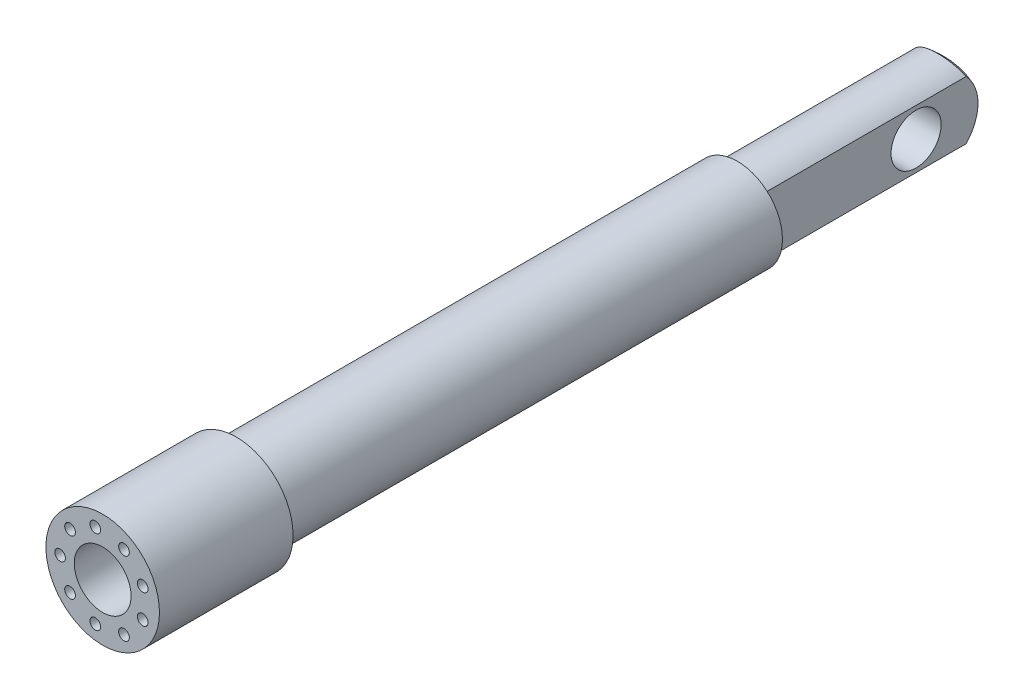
ISO-10303-21;
HEADER;
FILE_DESCRIPTION(('STEP AP214'),'2;1');
FILE_NAME('part.step','',(''),(''),'','','');
FILE_SCHEMA(('AUTOMOTIVE_DESIGN { 1 0 10303 214 1 1 1 1 }'));
ENDSEC;
DATA;
#1=APPLICATION_CONTEXT('core data for automotive mechanical design processes');
#2=APPLICATION_PROTOCOL_DEFINITION('international standard','automotive_design',2000,#1);
#3=PRODUCT_CONTEXT('',#1,'mechanical');
#4=PRODUCT('Part','Part','',(#3));
#5=PRODUCT_RELATED_PRODUCT_CATEGORY('part','',(#4));
#6=PRODUCT_DEFINITION_FORMATION('','',#4);
#7=PRODUCT_DEFINITION_CONTEXT('part definition',#1,'design');
#8=PRODUCT_DEFINITION('design','',#6,#7);
#9=PRODUCT_DEFINITION_SHAPE('','',#8);
#10=(LENGTH_UNIT() NAMED_UNIT(*) SI_UNIT(.MILLI.,.METRE.));
#11=(NAMED_UNIT(*) PLANE_ANGLE_UNIT() SI_UNIT($,.RADIAN.));
#12=(NAMED_UNIT(*) SI_UNIT($,.STERADIAN.) SOLID_ANGLE_UNIT());
#13=UNCERTAINTY_MEASURE_WITH_UNIT(LENGTH_MEASURE(1.E-05),#10,'distance_accuracy_value','');
#14=(GEOMETRIC_REPRESENTATION_CONTEXT(3) GLOBAL_UNCERTAINTY_ASSIGNED_CONTEXT((#13)) GLOBAL_UNIT_ASSIGNED_CONTEXT((#10,
#11,#12)) REPRESENTATION_CONTEXT('',''));
#15=CARTESIAN_POINT('',(0.,0.,0.));
#16=DIRECTION('',(0.,0.,1.));
#17=DIRECTION('',(1.,0.,0.));
#18=AXIS2_PLACEMENT_3D('',#15,#16,#17);
#19=CARTESIAN_POINT('',(0.,0.,-1300.));
#20=DIRECTION('',(0.,0.,1.));
#21=DIRECTION('',(1.,0.,0.));
#22=AXIS2_PLACEMENT_3D('',#19,#20,#21);
#23=CYLINDRICAL_SURFACE('',#22,57.5);
#24=CARTESIAN_POINT('',(-37.4999999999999,43.5889894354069,-1255.));
#25=CARTESIAN_POINT('',(-36.9034025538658,44.1022515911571,-1254.83220902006));
#26=CARTESIAN_POINT('',(-36.2961876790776,44.6033262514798,-1254.66486884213));
#27=CARTESIAN_POINT('',(-35.0611830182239,45.5805173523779,-1254.33216744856));
#28=CARTESIAN_POINT('',(-34.4333875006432,46.0566267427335,-1254.16680680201));
#29=CARTESIAN_POINT('',(-33.1581229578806,46.9830836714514,-1253.83921304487));
#30=CARTESIAN_POINT('',(-32.5106510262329,47.4334273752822,-1253.67698040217));
#31=CARTESIAN_POINT('',(-31.19695940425,48.3075793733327,-1253.35680326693));
#32=CARTESIAN_POINT('',(-30.5307389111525,48.7313865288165,-1253.19885895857));
#33=CARTESIAN_POINT('',(-29.1781653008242,49.5531329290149,-1252.88788306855));
#34=CARTESIAN_POINT('',(-28.4917511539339,49.9509788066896,-1252.73487012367));
#35=CARTESIAN_POINT('',(-27.1019802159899,50.7184655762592,-1252.43549675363));
#36=CARTESIAN_POINT('',(-26.3986246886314,51.0881085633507,-1252.28913583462));
#37=CARTESIAN_POINT('',(-24.9759593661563,51.7984897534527,-1252.00421358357));
#38=CARTESIAN_POINT('',(-24.2566504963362,52.1392296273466,-1251.86565180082));
#39=CARTESIAN_POINT('',(-22.8031162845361,52.7911203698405,-1251.59745208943));
#40=CARTESIAN_POINT('',(-22.0688906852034,53.1022707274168,-1251.46781431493));
#41=CARTESIAN_POINT('',(-20.3368868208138,53.7940445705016,-1251.17656833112));
#42=CARTESIAN_POINT('',(-19.3336532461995,54.162757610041,-1251.01890332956));
#43=CARTESIAN_POINT('',(-17.3054588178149,54.8444690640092,-1250.72400231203));
#44=CARTESIAN_POINT('',(-16.2804971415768,55.1574653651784,-1250.58676707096));
#45=CARTESIAN_POINT('',(-14.2120401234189,55.7262808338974,-1250.33500942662));
#46=CARTESIAN_POINT('',(-13.1685445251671,55.9820992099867,-1250.22048733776));
#47=CARTESIAN_POINT('',(-11.0686702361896,56.4347919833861,-1250.01636212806));
#48=CARTESIAN_POINT('',(-10.0123221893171,56.631785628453,-1249.92670862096));
#49=CARTESIAN_POINT('',(-7.88839565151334,56.9664727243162,-1249.77362273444));
#50=CARTESIAN_POINT('',(-6.82081723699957,57.1041665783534,-1249.7101901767));
#51=CARTESIAN_POINT('',(-4.67838378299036,57.3194689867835,-1249.61072637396));
#52=CARTESIAN_POINT('',(-3.60352936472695,57.3970826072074,-1249.57469281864));
#53=CARTESIAN_POINT('',(-1.77007023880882,57.4777466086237,-1249.53721522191));
#54=CARTESIAN_POINT('',(-1.01223942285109,57.4960861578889,-1249.52868116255));
#55=CARTESIAN_POINT('',(0.503649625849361,57.502789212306,-1249.52556364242));
#56=CARTESIAN_POINT('',(1.26170786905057,57.4911510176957,-1249.53098097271));
#57=CARTESIAN_POINT('',(2.77645316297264,57.4379282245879,-1249.55571876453));
#58=CARTESIAN_POINT('',(3.53314035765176,57.3963469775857,-1249.57503767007));
#59=CARTESIAN_POINT('',(5.04388212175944,57.2833577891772,-1249.62739761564));
#60=CARTESIAN_POINT('',(5.79793642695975,57.2119469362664,-1249.66043999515));
#61=CARTESIAN_POINT('',(7.30241576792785,57.0394459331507,-1249.73996644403));
#62=CARTESIAN_POINT('',(8.05283818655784,56.9383369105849,-1249.78645906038));
#63=CARTESIAN_POINT('',(9.54827906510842,56.7067275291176,-1249.8924571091));
#64=CARTESIAN_POINT('',(10.2932969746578,56.5762242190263,-1249.95196384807));
#65=CARTESIAN_POINT('',(11.7764686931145,56.2861939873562,-1250.08344930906));
#66=CARTESIAN_POINT('',(12.5146232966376,56.1266704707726,-1250.15542656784));
#67=CARTESIAN_POINT('',(13.9829205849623,55.7790048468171,-1250.31122394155));
#68=CARTESIAN_POINT('',(14.7130625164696,55.5908600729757,-1250.39504515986));
#69=CARTESIAN_POINT('',(16.8566202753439,54.9933644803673,-1250.65916063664));
#70=CARTESIAN_POINT('',(18.2572548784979,54.5442381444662,-1250.85519324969));
#71=CARTESIAN_POINT('',(21.0149987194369,53.5422554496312,-1251.28377684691));
#72=CARTESIAN_POINT('',(22.3721049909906,52.9893920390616,-1251.51633031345));
#73=CARTESIAN_POINT('',(25.0348045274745,51.7845786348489,-1252.01104852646));
#74=CARTESIAN_POINT('',(26.3404316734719,51.1326952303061,-1252.27319334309));
#75=CARTESIAN_POINT('',(28.894498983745,49.7340606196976,-1252.82011242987));
#76=CARTESIAN_POINT('',(30.1429562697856,48.9873380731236,-1253.10487985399));
#77=CARTESIAN_POINT('',(31.8978062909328,47.8455031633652,-1253.52662848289));
#78=CARTESIAN_POINT('',(32.4296152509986,47.486643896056,-1253.65742605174));
#79=CARTESIAN_POINT('',(33.4804530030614,46.7516864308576,-1253.92141598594));
#80=CARTESIAN_POINT('',(33.9994843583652,46.3755917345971,-1254.05460786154));
#81=CARTESIAN_POINT('',(35.0232977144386,45.6073173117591,-1254.32250880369));
#82=CARTESIAN_POINT('',(35.5281075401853,45.2151733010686,-1254.45721406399));
#83=CARTESIAN_POINT('',(36.5242775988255,44.4143631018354,-1254.72784631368));
#84=CARTESIAN_POINT('',(37.0156352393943,44.0056937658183,-1254.86377353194));
#85=CARTESIAN_POINT('',(37.5,43.5889894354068,-1255.));
#86=B_SPLINE_CURVE_WITH_KNOTS('',3,(#24,#25,#26,#27,#28,#29,#30,#31,#32,#33,#34,#35,#36,#37,#38,
#39,#40,#41,#42,#43,#44,#45,#46,#47,#48,#49,#50,#51,#52,#53,#54,#55,#56,#57,#58,#59,#60,#61,#62,
#63,#64,#65,#66,#67,#68,#69,#70,#71,#72,#73,#74,#75,#76,#77,#78,#79,#80,#81,#82,#83,#84,#85),
.UNSPECIFIED.,.F.,.F.,(4,2,2,2,2,2,2,2,2,2,2,2,2,2,2,2,2,2,2,2,2,2,2,2,2,2,2,2,2,2,4),(0.,
2.41390374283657,4.82848554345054,7.2434257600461,9.65846953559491,12.0817678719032,
14.5048860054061,16.9278639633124,19.3508837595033,22.5902167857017,25.8296726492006,
29.0691733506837,32.3020617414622,35.5349281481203,38.7675219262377,41.0411580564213,
43.3149231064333,45.5884336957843,47.8621662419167,50.1373468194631,52.4127559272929,
54.6878982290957,56.9632526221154,61.4096497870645,65.8563493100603,70.3000716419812,
74.7424543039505,76.706457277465,78.6700629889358,80.6295141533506,82.5893402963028),.UNSPECIFIED.);
#87=CARTESIAN_POINT('',(-37.4999999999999,43.5889894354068,-1255.));
#88=VERTEX_POINT('',#87);
#89=CARTESIAN_POINT('',(37.5,43.5889894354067,-1255.));
#90=VERTEX_POINT('',#89);
#91=EDGE_CURVE('E79',#88,#90,#86,.T.);
#92=ORIENTED_EDGE('',*,*,#91,.F.);
#93=DIRECTION('',(0.,0.,1.));
#94=VECTOR('',#93,1.);
#95=CARTESIAN_POINT('',(-37.4999999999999,43.5889894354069,-1300.));
#96=LINE('',#95,#94);
#97=CARTESIAN_POINT('',(-37.4999999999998,43.5889894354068,-950.));
#98=VERTEX_POINT('',#97);
#99=EDGE_CURVE('E84',#88,#98,#96,.T.);
#100=ORIENTED_EDGE('',*,*,#99,.T.);
#101=CARTESIAN_POINT('',(0.,0.,-950.));
#102=DIRECTION('',(0.,0.,1.));
#103=DIRECTION('',(1.,0.,0.));
#104=AXIS2_PLACEMENT_3D('',#101,#102,#103);
#105=CIRCLE('',#104,57.5);
#106=CARTESIAN_POINT('',(37.5,43.5889894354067,-950.));
#107=VERTEX_POINT('',#106);
#108=EDGE_CURVE('E61',#98,#107,#105,.F.);
#109=ORIENTED_EDGE('',*,*,#108,.T.);
#110=DIRECTION('',(0.,0.,1.));
#111=VECTOR('',#110,1.);
#112=CARTESIAN_POINT('',(37.5,43.5889894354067,-1300.));
#113=LINE('',#112,#111);
#114=EDGE_CURVE('E86',#107,#90,#113,.F.);
#115=ORIENTED_EDGE('',*,*,#114,.T.);
#116=EDGE_LOOP('',(#92,#100,#109,#115));
#117=FACE_BOUND('',#116,.T.);
#118=ADVANCED_FACE('F34',(#117),#23,.T.);
#119=CARTESIAN_POINT('',(37.5,-43.5889894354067,-1255.));
#120=CARTESIAN_POINT('',(36.903402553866,-44.102251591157,-1254.83220902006));
#121=CARTESIAN_POINT('',(36.2961876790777,-44.6033262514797,-1254.66486884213));
#122=CARTESIAN_POINT('',(35.061183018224,-45.5805173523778,-1254.33216744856));
#123=CARTESIAN_POINT('',(34.4333875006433,-46.0566267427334,-1254.16680680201));
#124=CARTESIAN_POINT('',(33.1581229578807,-46.9830836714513,-1253.83921304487));
#125=CARTESIAN_POINT('',(32.510651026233,-47.4334273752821,-1253.67698040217));
#126=CARTESIAN_POINT('',(31.1969594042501,-48.3075793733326,-1253.35680326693));
#127=CARTESIAN_POINT('',(30.5307389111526,-48.7313865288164,-1253.19885895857));
#128=CARTESIAN_POINT('',(29.1781653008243,-49.5531329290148,-1252.88788306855));
#129=CARTESIAN_POINT('',(28.491751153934,-49.9509788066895,-1252.73487012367));
#130=CARTESIAN_POINT('',(27.1019802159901,-50.7184655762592,-1252.43549675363));
#131=CARTESIAN_POINT('',(26.3986246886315,-51.0881085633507,-1252.28913583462));
#132=CARTESIAN_POINT('',(24.9759593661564,-51.7984897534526,-1252.00421358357));
#133=CARTESIAN_POINT('',(24.2566504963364,-52.1392296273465,-1251.86565180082));
#134=CARTESIAN_POINT('',(22.8031162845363,-52.7911203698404,-1251.59745208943));
#135=CARTESIAN_POINT('',(22.0688906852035,-53.1022707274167,-1251.46781431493));
#136=CARTESIAN_POINT('',(20.3368868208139,-53.7940445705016,-1251.17656833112));
#137=CARTESIAN_POINT('',(19.3336532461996,-54.1627576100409,-1251.01890332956));
#138=CARTESIAN_POINT('',(17.3054588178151,-54.8444690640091,-1250.72400231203));
#139=CARTESIAN_POINT('',(16.280497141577,-55.1574653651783,-1250.58676707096));
#140=CARTESIAN_POINT('',(14.2120401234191,-55.7262808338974,-1250.33500942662));
#141=CARTESIAN_POINT('',(13.1685445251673,-55.9820992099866,-1250.22048733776));
#142=CARTESIAN_POINT('',(11.0686702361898,-56.4347919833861,-1250.01636212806));
#143=CARTESIAN_POINT('',(10.0123221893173,-56.631785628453,-1249.92670862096));
#144=CARTESIAN_POINT('',(7.88839565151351,-56.9664727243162,-1249.77362273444));
#145=CARTESIAN_POINT('',(6.82081723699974,-57.1041665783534,-1249.7101901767));
#146=CARTESIAN_POINT('',(4.67838378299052,-57.3194689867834,-1249.61072637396));
#147=CARTESIAN_POINT('',(3.6035293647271,-57.3970826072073,-1249.57469281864));
#148=CARTESIAN_POINT('',(1.77007023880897,-57.4777466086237,-1249.53721522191));
#149=CARTESIAN_POINT('',(1.01223942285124,-57.4960861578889,-1249.52868116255));
#150=CARTESIAN_POINT('',(-0.503649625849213,-57.502789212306,-1249.52556364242));
#151=CARTESIAN_POINT('',(-1.26170786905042,-57.4911510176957,-1249.53098097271));
#152=CARTESIAN_POINT('',(-2.7764531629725,-57.4379282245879,-1249.55571876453));
#153=CARTESIAN_POINT('',(-3.53314035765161,-57.3963469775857,-1249.57503767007));
#154=CARTESIAN_POINT('',(-5.04388212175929,-57.2833577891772,-1249.62739761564));
#155=CARTESIAN_POINT('',(-5.79793642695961,-57.2119469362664,-1249.66043999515));
#156=CARTESIAN_POINT('',(-7.30241576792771,-57.0394459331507,-1249.73996644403));
#157=CARTESIAN_POINT('',(-8.0528381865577,-56.9383369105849,-1249.78645906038));
#158=CARTESIAN_POINT('',(-9.54827906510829,-56.7067275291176,-1249.8924571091));
#159=CARTESIAN_POINT('',(-10.2932969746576,-56.5762242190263,-1249.95196384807));
#160=CARTESIAN_POINT('',(-11.7764686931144,-56.2861939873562,-1250.08344930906));
#161=CARTESIAN_POINT('',(-12.5146232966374,-56.1266704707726,-1250.15542656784));
#162=CARTESIAN_POINT('',(-13.9829205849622,-55.7790048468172,-1250.31122394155));
#163=CARTESIAN_POINT('',(-14.7130625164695,-55.5908600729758,-1250.39504515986));
#164=CARTESIAN_POINT('',(-16.8566202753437,-54.9933644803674,-1250.65916063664));
#165=CARTESIAN_POINT('',(-18.2572548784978,-54.5442381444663,-1250.85519324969));
#166=CARTESIAN_POINT('',(-21.0149987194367,-53.5422554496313,-1251.28377684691));
#167=CARTESIAN_POINT('',(-22.3721049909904,-52.9893920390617,-1251.51633031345));
#168=CARTESIAN_POINT('',(-25.0348045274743,-51.784578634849,-1252.01104852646));
#169=CARTESIAN_POINT('',(-26.3404316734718,-51.1326952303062,-1252.27319334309));
#170=CARTESIAN_POINT('',(-28.8944989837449,-49.7340606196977,-1252.82011242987));
#171=CARTESIAN_POINT('',(-30.1429562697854,-48.9873380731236,-1253.10487985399));
#172=CARTESIAN_POINT('',(-31.8978062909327,-47.8455031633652,-1253.52662848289));
#173=CARTESIAN_POINT('',(-32.4296152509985,-47.486643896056,-1253.65742605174));
#174=CARTESIAN_POINT('',(-33.4804530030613,-46.7516864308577,-1253.92141598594));
#175=CARTESIAN_POINT('',(-33.9994843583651,-46.3755917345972,-1254.05460786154));
#176=CARTESIAN_POINT('',(-35.0232977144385,-45.6073173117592,-1254.32250880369));
#177=CARTESIAN_POINT('',(-35.5281075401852,-45.2151733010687,-1254.45721406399));
#178=CARTESIAN_POINT('',(-36.5242775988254,-44.4143631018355,-1254.72784631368));
#179=CARTESIAN_POINT('',(-37.0156352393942,-44.0056937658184,-1254.86377353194));
#180=CARTESIAN_POINT('',(-37.4999999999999,-43.5889894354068,-1255.));
#181=B_SPLINE_CURVE_WITH_KNOTS('',3,(#119,#120,#121,#122,#123,#124,#125,#126,#127,#128,#129,
#130,#131,#132,#133,#134,#135,#136,#137,#138,#139,#140,#141,#142,#143,#144,#145,#146,#147,#148,
#149,#150,#151,#152,#153,#154,#155,#156,#157,#158,#159,#160,#161,#162,#163,#164,#165,#166,#167,
#168,#169,#170,#171,#172,#173,#174,#175,#176,#177,#178,#179,#180),.UNSPECIFIED.,.F.,.F.,(4,2,2,
2,2,2,2,2,2,2,2,2,2,2,2,2,2,2,2,2,2,2,2,2,2,2,2,2,2,2,4),(0.,2.41390374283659,4.82848554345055,
7.24342576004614,9.65846953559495,12.0817678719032,14.5048860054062,16.9278639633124,
19.3508837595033,22.5902167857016,25.8296726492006,29.0691733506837,32.3020617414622,
35.5349281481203,38.7675219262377,41.0411580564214,43.3149231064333,45.5884336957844,
47.8621662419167,50.1373468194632,52.4127559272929,54.6878982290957,56.9632526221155,
61.4096497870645,65.8563493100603,70.3000716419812,74.7424543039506,76.7064572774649,
78.6700629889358,80.6295141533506,82.5893402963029),.UNSPECIFIED.);
#182=CARTESIAN_POINT('',(37.5,-43.5889894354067,-1255.));
#183=VERTEX_POINT('',#182);
#184=CARTESIAN_POINT('',(-37.4999999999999,-43.5889894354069,-1255.));
#185=VERTEX_POINT('',#184);
#186=EDGE_CURVE('E53',#183,#185,#181,.T.);
#187=ORIENTED_EDGE('',*,*,#186,.F.);
#188=DIRECTION('',(0.,0.,1.));
#189=VECTOR('',#188,1.);
#190=CARTESIAN_POINT('',(37.5,-43.5889894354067,-1300.));
#191=LINE('',#190,#189);
#192=CARTESIAN_POINT('',(37.5,-43.5889894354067,-950.));
#193=VERTEX_POINT('',#192);
#194=EDGE_CURVE('E101',#183,#193,#191,.T.);
#195=ORIENTED_EDGE('',*,*,#194,.T.);
#196=CARTESIAN_POINT('',(-37.4999999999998,-43.5889894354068,-950.));
#197=VERTEX_POINT('',#196);
#198=EDGE_CURVE('E47',#193,#197,#105,.F.);
#199=ORIENTED_EDGE('',*,*,#198,.T.);
#200=DIRECTION('',(0.,0.,1.));
#201=VECTOR('',#200,1.);
#202=CARTESIAN_POINT('',(-37.4999999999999,-43.5889894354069,-1300.));
#203=LINE('',#202,#201);
#204=EDGE_CURVE('E93',#197,#185,#203,.F.);
#205=ORIENTED_EDGE('',*,*,#204,.T.);
#206=EDGE_LOOP('',(#187,#195,#199,#205));
#207=FACE_BOUND('',#206,.T.);
#208=ADVANCED_FACE('F211',(#207),#23,.T.);
#209=CARTESIAN_POINT('',(37.5,-175.,-950.));
#210=DIRECTION('',(-1.,0.,0.));
#211=DIRECTION('',(0.,0.,1.));
#212=AXIS2_PLACEMENT_3D('',#209,#210,#211);
#213=PLANE('',#212);
#214=CARTESIAN_POINT('',(37.4999999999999,0.,-1180.));
#215=DIRECTION('',(1.,0.,0.));
#216=DIRECTION('',(0.,0.,-1.));
#217=AXIS2_PLACEMENT_3D('',#214,#215,#216);
#218=CIRCLE('',#217,37.5);
#219=CARTESIAN_POINT('',(37.4999999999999,0.,-1217.5));
#220=VERTEX_POINT('',#219);
#221=EDGE_CURVE('E178',#220,#220,#218,.T.);
#222=ORIENTED_EDGE('',*,*,#221,.F.);
#223=EDGE_LOOP('',(#222));
#224=FACE_BOUND('',#223,.T.);
#225=CARTESIAN_POINT('',(37.5,43.5889894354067,-1255.));
#226=CARTESIAN_POINT('',(37.5,42.8851714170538,-1255.63914926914));
#227=CARTESIAN_POINT('',(37.5,42.1695481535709,-1256.26534991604));
#228=CARTESIAN_POINT('',(37.5,40.7146566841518,-1257.49079116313));
#229=CARTESIAN_POINT('',(37.5,39.9753709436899,-1258.09001093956));
#230=CARTESIAN_POINT('',(37.5,38.4739110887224,-1259.25967004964));
#231=CARTESIAN_POINT('',(37.5,37.7117285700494,-1259.83009860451));
#232=CARTESIAN_POINT('',(37.5,36.1653173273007,-1260.94041957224));
#233=CARTESIAN_POINT('',(37.5,35.3810865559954,-1261.48030913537));
#234=CARTESIAN_POINT('',(37.5,33.7874318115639,-1262.53053314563));
#235=CARTESIAN_POINT('',(37.5,32.9779014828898,-1263.04070632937));
#236=CARTESIAN_POINT('',(37.5,31.3384584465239,-1264.02685974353));
#237=CARTESIAN_POINT('',(37.5,30.5085493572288,-1264.502845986));
#238=CARTESIAN_POINT('',(37.5,28.8293549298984,-1265.41907135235));
#239=CARTESIAN_POINT('',(37.5,27.9800722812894,-1265.85931539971));
#240=CARTESIAN_POINT('',(37.5,26.2632183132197,-1266.70256401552));
#241=CARTESIAN_POINT('',(37.5,25.3956467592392,-1267.10556810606));
#242=CARTESIAN_POINT('',(37.5,23.3456041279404,-1268.00328125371));
#243=CARTESIAN_POINT('',(37.5,22.1563433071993,-1268.48259278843));
#244=CARTESIAN_POINT('',(37.5,19.7508275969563,-1269.36824458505));
#245=CARTESIAN_POINT('',(37.5,18.5345700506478,-1269.77457762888));
#246=CARTESIAN_POINT('',(37.5,16.0791537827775,-1270.51117698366));
#247=CARTESIAN_POINT('',(37.5,14.8399944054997,-1270.84144111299));
#248=CARTESIAN_POINT('',(37.5,12.3466774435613,-1271.42246818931));
#249=CARTESIAN_POINT('',(37.5,11.0925694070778,-1271.67344345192));
#250=CARTESIAN_POINT('',(37.5,8.57094200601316,-1272.09503486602));
#251=CARTESIAN_POINT('',(37.5,7.30342292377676,-1272.26565270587));
#252=CARTESIAN_POINT('',(37.5,4.76012701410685,-1272.52506829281));
#253=CARTESIAN_POINT('',(37.5,3.48435128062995,-1272.61387666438));
#254=CARTESIAN_POINT('',(37.5,1.34424004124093,-1272.69353704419));
#255=CARTESIAN_POINT('',(37.5,0.480672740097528,-1272.70681863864));
#256=CARTESIAN_POINT('',(37.5,-1.2462927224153,-1272.69567353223));
#257=CARTESIAN_POINT('',(37.5,-2.10969087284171,-1272.67124489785));
#258=CARTESIAN_POINT('',(37.5,-3.83447012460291,-1272.58477284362));
#259=CARTESIAN_POINT('',(37.5,-4.69585149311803,-1272.5227347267));
#260=CARTESIAN_POINT('',(37.5,-6.41518922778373,-1272.36128624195));
#261=CARTESIAN_POINT('',(37.5,-7.27314525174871,-1272.26187223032));
#262=CARTESIAN_POINT('',(37.5,-8.98441196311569,-1272.02599630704));
#263=CARTESIAN_POINT('',(37.5,-9.83771992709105,-1271.88951465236));
#264=CARTESIAN_POINT('',(37.5,-11.5377721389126,-1271.58003467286));
#265=CARTESIAN_POINT('',(37.5,-12.3845157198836,-1271.40703268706));
#266=CARTESIAN_POINT('',(37.5,-14.0697788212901,-1271.02519060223));
#267=CARTESIAN_POINT('',(37.5,-14.9082992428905,-1270.81635447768));
#268=CARTESIAN_POINT('',(37.5,-16.5758852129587,-1270.36357218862));
#269=CARTESIAN_POINT('',(37.5,-17.4049498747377,-1270.1196227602));
#270=CARTESIAN_POINT('',(37.5,-19.0332114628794,-1269.60351841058));
#271=CARTESIAN_POINT('',(37.5,-19.8326561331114,-1269.33214428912));
#272=CARTESIAN_POINT('',(37.5,-21.4201038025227,-1268.75758817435));
#273=CARTESIAN_POINT('',(37.5,-22.2081057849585,-1268.45440337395));
#274=CARTESIAN_POINT('',(37.5,-23.7715050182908,-1267.81720607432));
#275=CARTESIAN_POINT('',(37.5,-24.5469028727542,-1267.4831950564));
#276=CARTESIAN_POINT('',(37.5,-26.0841777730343,-1266.78533728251));
#277=CARTESIAN_POINT('',(37.5,-26.846053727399,-1266.4214881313));
#278=CARTESIAN_POINT('',(37.5,-29.1095191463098,-1265.2869892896));
#279=CARTESIAN_POINT('',(37.5,-30.5896683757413,-1264.47309266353));
#280=CARTESIAN_POINT('',(37.5,-33.4857301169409,-1262.73908218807));
#281=CARTESIAN_POINT('',(37.5,-34.9016577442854,-1261.8189935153));
#282=CARTESIAN_POINT('',(37.5,-36.9230866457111,-1260.40157458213));
#283=CARTESIAN_POINT('',(37.5,-37.5556632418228,-1259.94240002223));
#284=CARTESIAN_POINT('',(37.5,-38.8056715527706,-1259.00406575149));
#285=CARTESIAN_POINT('',(37.5,-39.4231060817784,-1258.52490979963));
#286=CARTESIAN_POINT('',(37.5,-40.6409825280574,-1257.54869922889));
#287=CARTESIAN_POINT('',(37.5,-41.2414647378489,-1257.05169480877));
#288=CARTESIAN_POINT('',(37.5,-42.4269372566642,-1256.03936524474));
#289=CARTESIAN_POINT('',(37.5,-43.0119252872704,-1255.52403743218));
#290=CARTESIAN_POINT('',(37.5,-43.5889894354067,-1255.));
#291=B_SPLINE_CURVE_WITH_KNOTS('',3,(#225,#226,#227,#228,#229,#230,#231,#232,#233,#234,#235,
#236,#237,#238,#239,#240,#241,#242,#243,#244,#245,#246,#247,#248,#249,#250,#251,#252,#253,#254,
#255,#256,#257,#258,#259,#260,#261,#262,#263,#264,#265,#266,#267,#268,#269,#270,#271,#272,#273,
#274,#275,#276,#277,#278,#279,#280,#281,#282,#283,#284,#285,#286,#287,#288,#289,#290),
.UNSPECIFIED.,.F.,.F.,(4,2,2,2,2,2,2,2,2,2,2,2,2,2,2,2,2,2,2,2,2,2,2,2,2,2,2,2,2,2,2,2,4),(0.,
2.8520545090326,5.70627376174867,8.5615537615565,11.4170997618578,14.2869227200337,
17.1562397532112,20.0251608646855,22.8941187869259,26.7383640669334,30.5829893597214,
34.4277249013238,38.2620761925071,42.0963469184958,45.9301196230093,48.5203758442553,
51.1107648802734,53.7007887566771,56.2910652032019,58.8827240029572,61.4746427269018,
64.0662741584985,66.6581466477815,69.1902073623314,71.7224917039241,74.2546544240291,
76.7870206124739,81.8494182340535,86.9106180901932,89.2552797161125,91.5995022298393,
93.9375811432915,96.2760019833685),.UNSPECIFIED.);
#292=EDGE_CURVE('E87',#90,#183,#291,.T.);
#293=ORIENTED_EDGE('',*,*,#292,.F.);
#294=ORIENTED_EDGE('',*,*,#114,.F.);
#295=DIRECTION('',(0.,1.,0.));
#296=VECTOR('',#295,1.);
#297=CARTESIAN_POINT('',(37.5,-175.,-950.));
#298=LINE('',#297,#296);
#299=EDGE_CURVE('E92',#193,#107,#298,.T.);
#300=ORIENTED_EDGE('',*,*,#299,.F.);
#301=ORIENTED_EDGE('',*,*,#194,.F.);
#302=EDGE_LOOP('',(#293,#294,#300,#301));
#303=FACE_BOUND('',#302,.T.);
#304=ADVANCED_FACE('F195',(#224,#303),#213,.F.);
#305=CARTESIAN_POINT('',(-37.4999999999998,-175.,-950.));
#306=DIRECTION('',(1.,0.,0.));
#307=DIRECTION('',(0.,0.,-1.));
#308=AXIS2_PLACEMENT_3D('',#305,#306,#307);
#309=PLANE('',#308);
#310=CARTESIAN_POINT('',(-37.4999999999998,0.,-1180.));
#311=DIRECTION('',(1.,0.,0.));
#312=DIRECTION('',(0.,0.,-1.));
#313=AXIS2_PLACEMENT_3D('',#310,#311,#312);
#314=CIRCLE('',#313,37.5);
#315=CARTESIAN_POINT('',(-37.4999999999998,0.,-1217.5));
#316=VERTEX_POINT('',#315);
#317=EDGE_CURVE('E176',#316,#316,#314,.T.);
#318=ORIENTED_EDGE('',*,*,#317,.T.);
#319=EDGE_LOOP('',(#318));
#320=FACE_BOUND('',#319,.T.);
#321=CARTESIAN_POINT('',(-37.4999999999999,-43.5889894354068,-1255.));
#322=CARTESIAN_POINT('',(-37.4999999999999,-42.8843805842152,-1255.63986747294));
#323=CARTESIAN_POINT('',(-37.4999999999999,-42.1679398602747,-1256.26675723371));
#324=CARTESIAN_POINT('',(-37.4999999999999,-40.7113595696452,-1257.49351542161));
#325=CARTESIAN_POINT('',(-37.4999999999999,-39.9712023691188,-1258.09336290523));
#326=CARTESIAN_POINT('',(-37.4999999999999,-38.4679486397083,-1259.26420954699));
#327=CARTESIAN_POINT('',(-37.4999999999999,-37.7048436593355,-1259.83519786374));
#328=CARTESIAN_POINT('',(-37.4999999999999,-36.1565399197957,-1260.94656423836));
#329=CARTESIAN_POINT('',(-37.4999999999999,-35.3713391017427,-1261.48693942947));
#330=CARTESIAN_POINT('',(-37.4999999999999,-33.7756862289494,-1262.53806299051));
#331=CARTESIAN_POINT('',(-37.4999999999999,-32.9651273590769,-1263.04864933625));
#332=CARTESIAN_POINT('',(-37.4999999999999,-31.3235865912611,-1264.0355419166));
#333=CARTESIAN_POINT('',(-37.4999999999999,-30.4926083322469,-1264.51185420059));
#334=CARTESIAN_POINT('',(-37.4999999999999,-28.8112392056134,-1265.42863937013));
#335=CARTESIAN_POINT('',(-37.4999999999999,-27.9608510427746,-1265.86911721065));
#336=CARTESIAN_POINT('',(-37.4999999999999,-26.2417543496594,-1266.71273641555));
#337=CARTESIAN_POINT('',(-37.4999999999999,-25.3730455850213,-1267.11587730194));
#338=CARTESIAN_POINT('',(-37.4999999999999,-23.3202871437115,-1268.01380223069));
#339=CARTESIAN_POINT('',(-37.4999999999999,-22.1294365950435,-1268.49314695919));
#340=CARTESIAN_POINT('',(-37.4999999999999,-19.7207087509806,-1269.37867018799));
#341=CARTESIAN_POINT('',(-37.4999999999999,-18.502828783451,-1269.78484141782));
#342=CARTESIAN_POINT('',(-37.4999999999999,-16.0441531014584,-1270.52091470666));
#343=CARTESIAN_POINT('',(-37.4999999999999,-14.8033567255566,-1270.85081456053));
#344=CARTESIAN_POINT('',(-37.4999999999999,-12.3067913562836,-1271.43090371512));
#345=CARTESIAN_POINT('',(-37.4999999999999,-11.0510721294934,-1271.6813068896));
#346=CARTESIAN_POINT('',(-37.4999999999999,-8.52624873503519,-1272.10154947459));
#347=CARTESIAN_POINT('',(-37.4999999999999,-7.2571448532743,-1272.27139060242));
#348=CARTESIAN_POINT('',(-37.4999999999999,-4.71072728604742,-1272.5290509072));
#349=CARTESIAN_POINT('',(-37.4999999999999,-3.43341470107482,-1272.6168808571));
#350=CARTESIAN_POINT('',(-37.4999999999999,-1.29189871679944,-1272.69469829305));
#351=CARTESIAN_POINT('',(-37.4999999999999,-0.428446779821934,-1272.70721688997));
#352=CARTESIAN_POINT('',(-37.4999999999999,1.29825484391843,-1272.69455728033));
#353=CARTESIAN_POINT('',(-37.4999999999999,2.16150451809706,-1272.66937714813));
#354=CARTESIAN_POINT('',(-37.4999999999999,3.88595388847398,-1272.58141673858));
#355=CARTESIAN_POINT('',(-37.4999999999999,4.74715385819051,-1272.51864179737));
#356=CARTESIAN_POINT('',(-37.4999999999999,6.46609791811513,-1272.35573693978));
#357=CARTESIAN_POINT('',(-37.4999999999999,7.32384166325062,-1272.25560338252));
#358=CARTESIAN_POINT('',(-37.4999999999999,9.03465744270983,-1272.01830749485));
#359=CARTESIAN_POINT('',(-37.4999999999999,9.88772671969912,-1271.88112530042));
#360=CARTESIAN_POINT('',(-37.4999999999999,11.5872739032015,-1271.57026620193));
#361=CARTESIAN_POINT('',(-37.4999999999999,12.4337511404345,-1271.39658564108));
#362=CARTESIAN_POINT('',(-37.4999999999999,14.1184562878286,-1271.01341049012));
#363=CARTESIAN_POINT('',(-37.4999999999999,14.9566850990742,-1270.80391985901));
#364=CARTESIAN_POINT('',(-37.4999999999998,16.6236643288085,-1270.34985429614));
#365=CARTESIAN_POINT('',(-37.4999999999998,17.4524138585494,-1270.10527610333));
#366=CARTESIAN_POINT('',(-37.4999999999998,19.0802396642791,-1269.58788946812));
#367=CARTESIAN_POINT('',(-37.4999999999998,19.8795614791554,-1269.31585275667));
#368=CARTESIAN_POINT('',(-37.4999999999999,21.4667390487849,-1268.73998220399));
#369=CARTESIAN_POINT('',(-37.4999999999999,22.2545937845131,-1268.43614555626));
#370=CARTESIAN_POINT('',(-37.4999999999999,23.8176758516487,-1267.79765676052));
#371=CARTESIAN_POINT('',(-37.4999999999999,24.5929037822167,-1267.46300607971));
#372=CARTESIAN_POINT('',(-37.4999999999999,26.1298172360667,-1266.76388250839));
#373=CARTESIAN_POINT('',(-37.4999999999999,26.8915016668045,-1266.39940722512));
#374=CARTESIAN_POINT('',(-37.4999999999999,29.1543501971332,-1265.26305855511));
#375=CARTESIAN_POINT('',(-37.4999999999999,30.6340441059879,-1264.44796107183));
#376=CARTESIAN_POINT('',(-37.4999999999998,33.5291266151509,-1262.71161614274));
#377=CARTESIAN_POINT('',(-37.4999999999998,34.9445304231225,-1261.79039398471));
#378=CARTESIAN_POINT('',(-37.4999999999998,36.9615482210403,-1260.37389813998));
#379=CARTESIAN_POINT('',(-37.4999999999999,37.5903435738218,-1259.91686917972));
#380=CARTESIAN_POINT('',(-37.4999999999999,38.8329500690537,-1258.98306094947));
#381=CARTESIAN_POINT('',(-37.4999999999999,39.4467639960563,-1258.50628539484));
#382=CARTESIAN_POINT('',(-37.4999999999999,40.6575813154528,-1257.53504459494));
#383=CARTESIAN_POINT('',(-37.4999999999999,41.2546244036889,-1257.04062877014));
#384=CARTESIAN_POINT('',(-37.4999999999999,42.433388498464,-1256.03368169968));
#385=CARTESIAN_POINT('',(-37.4999999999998,43.0151072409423,-1255.52114780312));
#386=CARTESIAN_POINT('',(-37.4999999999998,43.5889894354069,-1255.));
#387=B_SPLINE_CURVE_WITH_KNOTS('',3,(#321,#322,#323,#324,#325,#326,#327,#328,#329,#330,#331,
#332,#333,#334,#335,#336,#337,#338,#339,#340,#341,#342,#343,#344,#345,#346,#347,#348,#349,#350,
#351,#352,#353,#354,#355,#356,#357,#358,#359,#360,#361,#362,#363,#364,#365,#366,#367,#368,#369,
#370,#371,#372,#373,#374,#375,#376,#377,#378,#379,#380,#381,#382,#383,#384,#385,#386),
.UNSPECIFIED.,.F.,.F.,(4,2,2,2,2,2,2,2,2,2,2,2,2,2,2,2,2,2,2,2,2,2,2,2,2,2,2,2,2,2,2,2,4),(0.,
2.85525905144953,5.71269271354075,8.57119195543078,11.4299584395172,14.3030498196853,
17.1756328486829,20.047817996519,22.9200399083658,26.7687370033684,30.6178162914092,
34.4670068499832,38.3057522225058,42.1444157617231,45.9825749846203,48.5724515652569,
51.162460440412,53.752101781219,56.3419955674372,58.933280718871,61.5248256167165,
64.1160841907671,66.7075837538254,69.2399352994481,71.7725105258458,74.3049652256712,
76.8376232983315,81.900563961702,86.9623006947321,89.2940078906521,91.6252783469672,
93.9504638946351,96.2759910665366),.UNSPECIFIED.);
#388=EDGE_CURVE('E12',#185,#88,#387,.T.);
#389=ORIENTED_EDGE('',*,*,#388,.F.);
#390=ORIENTED_EDGE('',*,*,#204,.F.);
#391=DIRECTION('',(0.,1.,0.));
#392=VECTOR('',#391,1.);
#393=CARTESIAN_POINT('',(-37.4999999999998,-175.,-950.));
#394=LINE('',#393,#392);
#395=EDGE_CURVE('E91',#197,#98,#394,.T.);
#396=ORIENTED_EDGE('',*,*,#395,.T.);
#397=ORIENTED_EDGE('',*,*,#99,.F.);
#398=EDGE_LOOP('',(#389,#390,#396,#397));
#399=FACE_BOUND('',#398,.T.);
#400=ADVANCED_FACE('F89',(#320,#399),#309,.F.);
#401=CARTESIAN_POINT('',(0.,0.,-950.));
#402=DIRECTION('',(0.,0.,1.));
#403=DIRECTION('',(1.,0.,0.));
#404=AXIS2_PLACEMENT_3D('',#401,#402,#403);
#405=PLANE('',#404);
#406=ORIENTED_EDGE('',*,*,#395,.F.);
#407=ORIENTED_EDGE('',*,*,#198,.F.);
#408=ORIENTED_EDGE('',*,*,#299,.T.);
#409=ORIENTED_EDGE('',*,*,#108,.F.);
#410=EDGE_LOOP('',(#406,#407,#408,#409));
#411=FACE_BOUND('',#410,.T.);
#412=CARTESIAN_POINT('',(0.,0.,-950.));
#413=DIRECTION('',(0.,0.,1.));
#414=DIRECTION('',(1.,0.,0.));
#415=AXIS2_PLACEMENT_3D('',#412,#413,#414);
#416=CIRCLE('',#415,67.5);
#417=CARTESIAN_POINT('',(67.5,0.,-950.));
#418=VERTEX_POINT('',#417);
#419=EDGE_CURVE('E163',#418,#418,#416,.T.);
#420=ORIENTED_EDGE('',*,*,#419,.F.);
#421=EDGE_LOOP('',(#420));
#422=FACE_BOUND('',#421,.T.);
#423=ADVANCED_FACE('F294',(#411,#422),#405,.F.);
#424=CARTESIAN_POINT('',(0.,0.,-200.));
#425=DIRECTION('',(0.,0.,1.));
#426=DIRECTION('',(1.,0.,0.));
#427=AXIS2_PLACEMENT_3D('',#424,#425,#426);
#428=CYLINDRICAL_SURFACE('',#427,85.);
#429=CARTESIAN_POINT('',(0.,0.,-200.));
#430=DIRECTION('',(0.,0.,1.));
#431=DIRECTION('',(1.,0.,0.));
#432=AXIS2_PLACEMENT_3D('',#429,#430,#431);
#433=CIRCLE('',#432,85.);
#434=CARTESIAN_POINT('',(85.,0.,-200.));
#435=VERTEX_POINT('',#434);
#436=EDGE_CURVE('E172',#435,#435,#433,.T.);
#437=ORIENTED_EDGE('',*,*,#436,.T.);
#438=EDGE_LOOP('',(#437));
#439=FACE_BOUND('',#438,.T.);
#440=CARTESIAN_POINT('',(0.,0.,0.));
#441=DIRECTION('',(0.,0.,1.));
#442=DIRECTION('',(1.,0.,0.));
#443=AXIS2_PLACEMENT_3D('',#440,#441,#442);
#444=CIRCLE('',#443,85.);
#445=CARTESIAN_POINT('',(85.,0.,0.));
#446=VERTEX_POINT('',#445);
#447=EDGE_CURVE('E169',#446,#446,#444,.T.);
#448=ORIENTED_EDGE('',*,*,#447,.F.);
#449=EDGE_LOOP('',(#448));
#450=FACE_BOUND('',#449,.T.);
#451=ADVANCED_FACE('F36',(#439,#450),#428,.T.);
#452=CARTESIAN_POINT('',(0.,0.,-200.));
#453=DIRECTION('',(0.,0.,1.));
#454=DIRECTION('',(1.,0.,0.));
#455=AXIS2_PLACEMENT_3D('',#452,#453,#454);
#456=PLANE('',#455);
#457=CARTESIAN_POINT('',(0.,0.,-200.));
#458=DIRECTION('',(0.,0.,1.));
#459=DIRECTION('',(1.,0.,0.));
#460=AXIS2_PLACEMENT_3D('',#457,#458,#459);
#461=CIRCLE('',#460,67.5);
#462=CARTESIAN_POINT('',(67.5,0.,-200.));
#463=VERTEX_POINT('',#462);
#464=EDGE_CURVE('E166',#463,#463,#461,.T.);
#465=ORIENTED_EDGE('',*,*,#464,.T.);
#466=EDGE_LOOP('',(#465));
#467=FACE_BOUND('',#466,.T.);
#468=ORIENTED_EDGE('',*,*,#436,.F.);
#469=EDGE_LOOP('',(#468));
#470=FACE_BOUND('',#469,.T.);
#471=ADVANCED_FACE('F303',(#467,#470),#456,.F.);
#472=CARTESIAN_POINT('',(0.,0.,0.));
#473=DIRECTION('',(0.,0.,1.));
#474=DIRECTION('',(1.,0.,0.));
#475=AXIS2_PLACEMENT_3D('',#472,#473,#474);
#476=PLANE('',#475);
#477=CARTESIAN_POINT('',(-48.8353332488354,40.9777101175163,0.));
#478=DIRECTION('',(0.,0.,1.));
#479=DIRECTION('',(0.766044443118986,-0.64278760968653,0.));
#480=AXIS2_PLACEMENT_3D('',#477,#478,#479);
#481=CIRCLE('',#480,8.);
#482=CARTESIAN_POINT('',(-42.7069777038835,35.835409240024,0.));
#483=VERTEX_POINT('',#482);
#484=EDGE_CURVE('E103',#483,#483,#481,.T.);
#485=ORIENTED_EDGE('',*,*,#484,.F.);
#486=EDGE_LOOP('',(#485));
#487=FACE_BOUND('',#486,.T.);
#488=CARTESIAN_POINT('',(-11.0700713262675,62.7814942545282,0.));
#489=DIRECTION('',(0.,0.,1.));
#490=DIRECTION('',(0.17364817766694,-0.984807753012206,0.));
#491=AXIS2_PLACEMENT_3D('',#488,#489,#490);
#492=CIRCLE('',#491,8.);
#493=CARTESIAN_POINT('',(-9.68088590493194,54.9030322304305,0.));
#494=VERTEX_POINT('',#493);
#495=EDGE_CURVE('E109',#494,#494,#492,.T.);
#496=ORIENTED_EDGE('',*,*,#495,.F.);
#497=EDGE_LOOP('',(#496));
#498=FACE_BOUND('',#497,.T.);
#499=CARTESIAN_POINT('',(31.8749999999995,55.2091194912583,0.));
#500=DIRECTION('',(0.,0.,1.));
#501=DIRECTION('',(-0.499999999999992,-0.866025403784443,0.));
#502=AXIS2_PLACEMENT_3D('',#499,#500,#501);
#503=CIRCLE('',#502,8.);
#504=CARTESIAN_POINT('',(27.8749999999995,48.2809162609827,0.));
#505=VERTEX_POINT('',#504);
#506=EDGE_CURVE('E115',#505,#505,#503,.T.);
#507=ORIENTED_EDGE('',*,*,#506,.F.);
#508=EDGE_LOOP('',(#507));
#509=FACE_BOUND('',#508,.T.);
#510=CARTESIAN_POINT('',(59.9054045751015,21.8037841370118,0.));
#511=DIRECTION('',(0.,0.,1.));
#512=DIRECTION('',(-0.939692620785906,-0.342020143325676,0.));
#513=AXIS2_PLACEMENT_3D('',#510,#511,#512);
#514=CIRCLE('',#513,8.);
#515=CARTESIAN_POINT('',(52.3878636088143,19.0676229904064,0.));
#516=VERTEX_POINT('',#515);
#517=EDGE_CURVE('E121',#516,#516,#514,.T.);
#518=ORIENTED_EDGE('',*,*,#517,.F.);
#519=EDGE_LOOP('',(#518));
#520=FACE_BOUND('',#519,.T.);
#521=CARTESIAN_POINT('',(59.9054045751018,-21.803784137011,0.));
#522=DIRECTION('',(0.,0.,1.));
#523=DIRECTION('',(-0.939692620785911,0.342020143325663,0.));
#524=AXIS2_PLACEMENT_3D('',#521,#522,#523);
#525=CIRCLE('',#524,8.);
#526=CARTESIAN_POINT('',(52.3878636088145,-19.0676229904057,0.));
#527=VERTEX_POINT('',#526);
#528=EDGE_CURVE('E127',#527,#527,#525,.T.);
#529=ORIENTED_EDGE('',*,*,#528,.F.);
#530=EDGE_LOOP('',(#529));
#531=FACE_BOUND('',#530,.T.);
#532=CARTESIAN_POINT('',(31.8750000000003,-55.2091194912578,0.));
#533=DIRECTION('',(0.,0.,1.));
#534=DIRECTION('',(-0.500000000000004,0.866025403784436,0.));
#535=AXIS2_PLACEMENT_3D('',#532,#533,#534);
#536=CIRCLE('',#535,8.);
#537=CARTESIAN_POINT('',(27.8750000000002,-48.2809162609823,0.));
#538=VERTEX_POINT('',#537);
#539=EDGE_CURVE('E133',#538,#538,#536,.T.);
#540=ORIENTED_EDGE('',*,*,#539,.F.);
#541=EDGE_LOOP('',(#540));
#542=FACE_BOUND('',#541,.T.);
#543=CARTESIAN_POINT('',(-11.0700713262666,-62.7814942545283,0.));
#544=DIRECTION('',(0.,0.,1.));
#545=DIRECTION('',(0.173648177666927,0.984807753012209,0.));
#546=AXIS2_PLACEMENT_3D('',#543,#544,#545);
#547=CIRCLE('',#546,8.);
#548=CARTESIAN_POINT('',(-9.68088590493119,-54.9030322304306,0.));
#549=VERTEX_POINT('',#548);
#550=EDGE_CURVE('E139',#549,#549,#547,.T.);
#551=ORIENTED_EDGE('',*,*,#550,.F.);
#552=EDGE_LOOP('',(#551));
#553=FACE_BOUND('',#552,.T.);
#554=CARTESIAN_POINT('',(-48.8353332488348,-40.977710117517,0.));
#555=DIRECTION('',(0.,0.,1.));
#556=DIRECTION('',(0.766044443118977,0.642787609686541,0.));
#557=AXIS2_PLACEMENT_3D('',#554,#555,#556);
#558=CIRCLE('',#557,8.);
#559=CARTESIAN_POINT('',(-42.706977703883,-35.8354092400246,0.));
#560=VERTEX_POINT('',#559);
#561=EDGE_CURVE('E145',#560,#560,#558,.T.);
#562=ORIENTED_EDGE('',*,*,#561,.F.);
#563=EDGE_LOOP('',(#562));
#564=FACE_BOUND('',#563,.T.);
#565=CARTESIAN_POINT('',(-63.75,0.,0.));
#566=DIRECTION('',(0.,0.,1.));
#567=DIRECTION('',(1.,0.,0.));
#568=AXIS2_PLACEMENT_3D('',#565,#566,#567);
#569=CIRCLE('',#568,8.);
#570=CARTESIAN_POINT('',(-55.75,0.,0.));
#571=VERTEX_POINT('',#570);
#572=EDGE_CURVE('E151',#571,#571,#569,.T.);
#573=ORIENTED_EDGE('',*,*,#572,.F.);
#574=EDGE_LOOP('',(#573));
#575=FACE_BOUND('',#574,.T.);
#576=CARTESIAN_POINT('',(0.,0.,0.));
#577=DIRECTION('',(0.,0.,1.));
#578=DIRECTION('',(1.,0.,0.));
#579=AXIS2_PLACEMENT_3D('',#576,#577,#578);
#580=CIRCLE('',#579,42.5);
#581=CARTESIAN_POINT('',(42.5,0.,0.));
#582=VERTEX_POINT('',#581);
#583=EDGE_CURVE('E157',#582,#582,#580,.T.);
#584=ORIENTED_EDGE('',*,*,#583,.F.);
#585=EDGE_LOOP('',(#584));
#586=FACE_BOUND('',#585,.T.);
#587=ORIENTED_EDGE('',*,*,#447,.T.);
#588=EDGE_LOOP('',(#587));
#589=FACE_BOUND('',#588,.T.);
#590=ADVANCED_FACE('F300',(#487,#498,#509,#520,#531,#542,#553,#564,#575,#586,#589),#476,.T.);
#591=CARTESIAN_POINT('',(0.,0.,-950.));
#592=DIRECTION('',(0.,0.,1.));
#593=DIRECTION('',(1.,0.,0.));
#594=AXIS2_PLACEMENT_3D('',#591,#592,#593);
#595=CYLINDRICAL_SURFACE('',#594,67.5);
#596=CARTESIAN_POINT('',(67.5,0.,-950.));
#597=CARTESIAN_POINT('',(67.5,0.,-942.1875));
#598=CARTESIAN_POINT('',(67.5,0.,-934.375));
#599=CARTESIAN_POINT('',(67.5,0.,-918.75));
#600=CARTESIAN_POINT('',(67.5,0.,-910.9375));
#601=CARTESIAN_POINT('',(67.5,0.,-895.3125));
#602=CARTESIAN_POINT('',(67.5,0.,-887.5));
#603=CARTESIAN_POINT('',(67.5,0.,-871.875));
#604=CARTESIAN_POINT('',(67.5,0.,-864.0625));
#605=CARTESIAN_POINT('',(67.5,0.,-848.4375));
#606=CARTESIAN_POINT('',(67.5,0.,-840.625));
#607=CARTESIAN_POINT('',(67.5,0.,-825.));
#608=CARTESIAN_POINT('',(67.5,0.,-817.1875));
#609=CARTESIAN_POINT('',(67.5,0.,-801.5625));
#610=CARTESIAN_POINT('',(67.5,0.,-793.75));
#611=CARTESIAN_POINT('',(67.5,0.,-778.125));
#612=CARTESIAN_POINT('',(67.5,0.,-770.3125));
#613=CARTESIAN_POINT('',(67.5,0.,-754.6875));
#614=CARTESIAN_POINT('',(67.5,0.,-746.875));
#615=CARTESIAN_POINT('',(67.5,0.,-731.25));
#616=CARTESIAN_POINT('',(67.5,0.,-723.4375));
#617=CARTESIAN_POINT('',(67.5,0.,-707.8125));
#618=CARTESIAN_POINT('',(67.5,0.,-700.));
#619=CARTESIAN_POINT('',(67.5,0.,-684.375));
#620=CARTESIAN_POINT('',(67.5,0.,-676.5625));
#621=CARTESIAN_POINT('',(67.5,0.,-660.9375));
#622=CARTESIAN_POINT('',(67.5,0.,-653.125));
#623=CARTESIAN_POINT('',(67.5,0.,-637.5));
#624=CARTESIAN_POINT('',(67.5,0.,-629.6875));
#625=CARTESIAN_POINT('',(67.5,0.,-614.0625));
#626=CARTESIAN_POINT('',(67.5,0.,-606.25));
#627=CARTESIAN_POINT('',(67.5,0.,-590.625));
#628=CARTESIAN_POINT('',(67.5,0.,-582.8125));
#629=CARTESIAN_POINT('',(67.5,0.,-567.1875));
#630=CARTESIAN_POINT('',(67.5,0.,-559.375));
#631=CARTESIAN_POINT('',(67.5,0.,-543.75));
#632=CARTESIAN_POINT('',(67.5,0.,-535.9375));
#633=CARTESIAN_POINT('',(67.5,0.,-520.3125));
#634=CARTESIAN_POINT('',(67.5,0.,-512.5));
#635=CARTESIAN_POINT('',(67.5,0.,-496.875));
#636=CARTESIAN_POINT('',(67.5,0.,-489.0625));
#637=CARTESIAN_POINT('',(67.5,0.,-473.4375));
#638=CARTESIAN_POINT('',(67.5,0.,-465.625));
#639=CARTESIAN_POINT('',(67.5,0.,-450.));
#640=CARTESIAN_POINT('',(67.5,0.,-442.1875));
#641=CARTESIAN_POINT('',(67.5,0.,-426.5625));
#642=CARTESIAN_POINT('',(67.5,0.,-418.75));
#643=CARTESIAN_POINT('',(67.5,0.,-403.125));
#644=CARTESIAN_POINT('',(67.5,0.,-395.3125));
#645=CARTESIAN_POINT('',(67.5,0.,-379.6875));
#646=CARTESIAN_POINT('',(67.5,0.,-371.875));
#647=CARTESIAN_POINT('',(67.5,0.,-356.25));
#648=CARTESIAN_POINT('',(67.5,0.,-348.4375));
#649=CARTESIAN_POINT('',(67.5,0.,-332.8125));
#650=CARTESIAN_POINT('',(67.5,0.,-325.));
#651=CARTESIAN_POINT('',(67.5,0.,-309.375));
#652=CARTESIAN_POINT('',(67.5,0.,-301.5625));
#653=CARTESIAN_POINT('',(67.5,0.,-285.9375));
#654=CARTESIAN_POINT('',(67.5,0.,-278.125));
#655=CARTESIAN_POINT('',(67.5,0.,-262.5));
#656=CARTESIAN_POINT('',(67.5,0.,-254.6875));
#657=CARTESIAN_POINT('',(67.5,0.,-239.0625));
#658=CARTESIAN_POINT('',(67.5,0.,-231.25));
#659=CARTESIAN_POINT('',(67.5,0.,-215.625));
#660=CARTESIAN_POINT('',(67.5,0.,-207.8125));
#661=CARTESIAN_POINT('',(67.5,0.,-200.));
#662=B_SPLINE_CURVE_WITH_KNOTS('',3,(#596,#597,#598,#599,#600,#601,#602,#603,#604,#605,#606,
#607,#608,#609,#610,#611,#612,#613,#614,#615,#616,#617,#618,#619,#620,#621,#622,#623,#624,#625,
#626,#627,#628,#629,#630,#631,#632,#633,#634,#635,#636,#637,#638,#639,#640,#641,#642,#643,#644,
#645,#646,#647,#648,#649,#650,#651,#652,#653,#654,#655,#656,#657,#658,#659,#660,#661),
.UNSPECIFIED.,.F.,.F.,(4,2,2,2,2,2,2,2,2,2,2,2,2,2,2,2,2,2,2,2,2,2,2,2,2,2,2,2,2,2,2,2,4),(0.,
23.4375000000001,46.8750000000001,70.3125000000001,93.7500000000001,117.1875,140.625,164.0625,
187.5,210.9375,234.375,257.8125,281.25,304.6875,328.125,351.5625,375.,398.4375,421.875,445.3125,
468.75,492.1875,515.625,539.0625,562.5,585.9375,609.375,632.8125,656.25,679.6875,703.125,
726.5625,750.),.UNSPECIFIED.);
#663=EDGE_CURVE('BSEAM292',#418,#463,#662,.T.);
#664=ORIENTED_EDGE('',*,*,#419,.T.);
#665=ORIENTED_EDGE('',*,*,#464,.F.);
#666=ORIENTED_EDGE('',*,*,#663,.T.);
#667=ORIENTED_EDGE('',*,*,#663,.F.);
#668=EDGE_LOOP('',(#664,#666,#665,#667));
#669=FACE_BOUND('',#668,.T.);
#670=ADVANCED_FACE('F292',(#669),#595,.T.);
#671=CARTESIAN_POINT('',(0.,0.,-1070.20815280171));
#672=DIRECTION('',(0.,0.,1.));
#673=DIRECTION('',(1.,0.,0.));
#674=AXIS2_PLACEMENT_3D('',#671,#672,#673);
#675=CYLINDRICAL_SURFACE('',#674,42.5);
#676=CARTESIAN_POINT('',(0.,0.,-920.));
#677=DIRECTION('',(0.,0.,1.));
#678=DIRECTION('',(1.,0.,0.));
#679=AXIS2_PLACEMENT_3D('',#676,#677,#678);
#680=CIRCLE('',#679,42.5);
#681=CARTESIAN_POINT('',(42.5,0.,-920.));
#682=VERTEX_POINT('',#681);
#683=EDGE_CURVE('E160',#682,#682,#680,.F.);
#684=ORIENTED_EDGE('',*,*,#683,.T.);
#685=EDGE_LOOP('',(#684));
#686=FACE_BOUND('',#685,.T.);
#687=ORIENTED_EDGE('',*,*,#583,.T.);
#688=EDGE_LOOP('',(#687));
#689=FACE_BOUND('',#688,.T.);
#690=ADVANCED_FACE('F288',(#686,#689),#675,.F.);
#691=CARTESIAN_POINT('',(0.,0.,-920.));
#692=DIRECTION('',(0.,0.,1.));
#693=DIRECTION('',(1.,0.,0.));
#694=AXIS2_PLACEMENT_3D('',#691,#692,#693);
#695=PLANE('',#694);
#696=ORIENTED_EDGE('',*,*,#683,.F.);
#697=EDGE_LOOP('',(#696));
#698=FACE_BOUND('',#697,.T.);
#699=ADVANCED_FACE('F284',(#698),#695,.T.);
#700=CARTESIAN_POINT('',(-63.75,0.,-85.));
#701=DIRECTION('',(0.,0.,1.));
#702=DIRECTION('',(1.,0.,0.));
#703=AXIS2_PLACEMENT_3D('',#700,#701,#702);
#704=CYLINDRICAL_SURFACE('',#703,8.);
#705=CARTESIAN_POINT('',(-63.75,0.,-85.));
#706=DIRECTION('',(0.,0.,1.));
#707=DIRECTION('',(1.,0.,0.));
#708=AXIS2_PLACEMENT_3D('',#705,#706,#707);
#709=CIRCLE('',#708,8.);
#710=CARTESIAN_POINT('',(-55.75,0.,-85.));
#711=VERTEX_POINT('',#710);
#712=EDGE_CURVE('E154',#711,#711,#709,.T.);
#713=ORIENTED_EDGE('',*,*,#712,.F.);
#714=EDGE_LOOP('',(#713));
#715=FACE_BOUND('',#714,.T.);
#716=ORIENTED_EDGE('',*,*,#572,.T.);
#717=EDGE_LOOP('',(#716));
#718=FACE_BOUND('',#717,.T.);
#719=ADVANCED_FACE('F280',(#715,#718),#704,.F.);
#720=CARTESIAN_POINT('',(-63.75,0.,-85.));
#721=DIRECTION('',(0.,0.,1.));
#722=DIRECTION('',(1.,0.,0.));
#723=AXIS2_PLACEMENT_3D('',#720,#721,#722);
#724=PLANE('',#723);
#725=ORIENTED_EDGE('',*,*,#712,.T.);
#726=EDGE_LOOP('',(#725));
#727=FACE_BOUND('',#726,.T.);
#728=ADVANCED_FACE('F276',(#727),#724,.T.);
#729=CARTESIAN_POINT('',(-48.8353332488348,-40.977710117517,-85.));
#730=DIRECTION('',(0.,0.,1.));
#731=DIRECTION('',(1.,0.,0.));
#732=AXIS2_PLACEMENT_3D('',#729,#730,#731);
#733=CYLINDRICAL_SURFACE('',#732,8.);
#734=CARTESIAN_POINT('',(-48.8353332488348,-40.977710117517,-85.));
#735=DIRECTION('',(0.,0.,1.));
#736=DIRECTION('',(0.766044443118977,0.642787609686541,0.));
#737=AXIS2_PLACEMENT_3D('',#734,#735,#736);
#738=CIRCLE('',#737,8.);
#739=CARTESIAN_POINT('',(-42.706977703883,-35.8354092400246,-85.));
#740=VERTEX_POINT('',#739);
#741=EDGE_CURVE('E148',#740,#740,#738,.T.);
#742=ORIENTED_EDGE('',*,*,#741,.F.);
#743=EDGE_LOOP('',(#742));
#744=FACE_BOUND('',#743,.T.);
#745=ORIENTED_EDGE('',*,*,#561,.T.);
#746=EDGE_LOOP('',(#745));
#747=FACE_BOUND('',#746,.T.);
#748=ADVANCED_FACE('F272',(#744,#747),#733,.F.);
#749=CARTESIAN_POINT('',(-48.8353332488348,-40.977710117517,-85.));
#750=DIRECTION('',(0.,0.,1.));
#751=DIRECTION('',(0.766044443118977,0.642787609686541,0.));
#752=AXIS2_PLACEMENT_3D('',#749,#750,#751);
#753=PLANE('',#752);
#754=ORIENTED_EDGE('',*,*,#741,.T.);
#755=EDGE_LOOP('',(#754));
#756=FACE_BOUND('',#755,.T.);
#757=ADVANCED_FACE('F268',(#756),#753,.T.);
#758=CARTESIAN_POINT('',(-11.0700713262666,-62.7814942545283,-85.));
#759=DIRECTION('',(0.,0.,1.));
#760=DIRECTION('',(1.,0.,0.));
#761=AXIS2_PLACEMENT_3D('',#758,#759,#760);
#762=CYLINDRICAL_SURFACE('',#761,8.);
#763=CARTESIAN_POINT('',(-11.0700713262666,-62.7814942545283,-85.));
#764=DIRECTION('',(0.,0.,1.));
#765=DIRECTION('',(0.173648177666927,0.984807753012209,0.));
#766=AXIS2_PLACEMENT_3D('',#763,#764,#765);
#767=CIRCLE('',#766,8.);
#768=CARTESIAN_POINT('',(-9.68088590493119,-54.9030322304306,-85.));
#769=VERTEX_POINT('',#768);
#770=EDGE_CURVE('E142',#769,#769,#767,.T.);
#771=ORIENTED_EDGE('',*,*,#770,.F.);
#772=EDGE_LOOP('',(#771));
#773=FACE_BOUND('',#772,.T.);
#774=ORIENTED_EDGE('',*,*,#550,.T.);
#775=EDGE_LOOP('',(#774));
#776=FACE_BOUND('',#775,.T.);
#777=ADVANCED_FACE('F264',(#773,#776),#762,.F.);
#778=CARTESIAN_POINT('',(-11.0700713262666,-62.7814942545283,-85.));
#779=DIRECTION('',(0.,0.,1.));
#780=DIRECTION('',(0.173648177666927,0.984807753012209,0.));
#781=AXIS2_PLACEMENT_3D('',#778,#779,#780);
#782=PLANE('',#781);
#783=ORIENTED_EDGE('',*,*,#770,.T.);
#784=EDGE_LOOP('',(#783));
#785=FACE_BOUND('',#784,.T.);
#786=ADVANCED_FACE('F260',(#785),#782,.T.);
#787=CARTESIAN_POINT('',(31.8750000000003,-55.2091194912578,-85.));
#788=DIRECTION('',(0.,0.,1.));
#789=DIRECTION('',(1.,0.,0.));
#790=AXIS2_PLACEMENT_3D('',#787,#788,#789);
#791=CYLINDRICAL_SURFACE('',#790,8.);
#792=CARTESIAN_POINT('',(31.8750000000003,-55.2091194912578,-85.));
#793=DIRECTION('',(0.,0.,1.));
#794=DIRECTION('',(-0.500000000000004,0.866025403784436,0.));
#795=AXIS2_PLACEMENT_3D('',#792,#793,#794);
#796=CIRCLE('',#795,8.);
#797=CARTESIAN_POINT('',(27.8750000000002,-48.2809162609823,-85.));
#798=VERTEX_POINT('',#797);
#799=EDGE_CURVE('E136',#798,#798,#796,.T.);
#800=ORIENTED_EDGE('',*,*,#799,.F.);
#801=EDGE_LOOP('',(#800));
#802=FACE_BOUND('',#801,.T.);
#803=ORIENTED_EDGE('',*,*,#539,.T.);
#804=EDGE_LOOP('',(#803));
#805=FACE_BOUND('',#804,.T.);
#806=ADVANCED_FACE('F256',(#802,#805),#791,.F.);
#807=CARTESIAN_POINT('',(31.8750000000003,-55.2091194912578,-85.));
#808=DIRECTION('',(0.,0.,1.));
#809=DIRECTION('',(-0.500000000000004,0.866025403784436,0.));
#810=AXIS2_PLACEMENT_3D('',#807,#808,#809);
#811=PLANE('',#810);
#812=ORIENTED_EDGE('',*,*,#799,.T.);
#813=EDGE_LOOP('',(#812));
#814=FACE_BOUND('',#813,.T.);
#815=ADVANCED_FACE('F252',(#814),#811,.T.);
#816=CARTESIAN_POINT('',(59.9054045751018,-21.803784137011,-85.));
#817=DIRECTION('',(0.,0.,1.));
#818=DIRECTION('',(1.,0.,0.));
#819=AXIS2_PLACEMENT_3D('',#816,#817,#818);
#820=CYLINDRICAL_SURFACE('',#819,8.);
#821=CARTESIAN_POINT('',(59.9054045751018,-21.803784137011,-85.));
#822=DIRECTION('',(0.,0.,1.));
#823=DIRECTION('',(-0.939692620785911,0.342020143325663,0.));
#824=AXIS2_PLACEMENT_3D('',#821,#822,#823);
#825=CIRCLE('',#824,8.);
#826=CARTESIAN_POINT('',(52.3878636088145,-19.0676229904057,-85.));
#827=VERTEX_POINT('',#826);
#828=EDGE_CURVE('E130',#827,#827,#825,.T.);
#829=ORIENTED_EDGE('',*,*,#828,.F.);
#830=EDGE_LOOP('',(#829));
#831=FACE_BOUND('',#830,.T.);
#832=ORIENTED_EDGE('',*,*,#528,.T.);
#833=EDGE_LOOP('',(#832));
#834=FACE_BOUND('',#833,.T.);
#835=ADVANCED_FACE('F248',(#831,#834),#820,.F.);
#836=CARTESIAN_POINT('',(59.9054045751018,-21.803784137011,-85.));
#837=DIRECTION('',(0.,0.,1.));
#838=DIRECTION('',(-0.939692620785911,0.342020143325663,0.));
#839=AXIS2_PLACEMENT_3D('',#836,#837,#838);
#840=PLANE('',#839);
#841=ORIENTED_EDGE('',*,*,#828,.T.);
#842=EDGE_LOOP('',(#841));
#843=FACE_BOUND('',#842,.T.);
#844=ADVANCED_FACE('F244',(#843),#840,.T.);
#845=CARTESIAN_POINT('',(59.9054045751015,21.8037841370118,-85.));
#846=DIRECTION('',(0.,0.,1.));
#847=DIRECTION('',(1.,0.,0.));
#848=AXIS2_PLACEMENT_3D('',#845,#846,#847);
#849=CYLINDRICAL_SURFACE('',#848,8.);
#850=CARTESIAN_POINT('',(59.9054045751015,21.8037841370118,-85.));
#851=DIRECTION('',(0.,0.,1.));
#852=DIRECTION('',(-0.939692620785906,-0.342020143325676,0.));
#853=AXIS2_PLACEMENT_3D('',#850,#851,#852);
#854=CIRCLE('',#853,8.);
#855=CARTESIAN_POINT('',(52.3878636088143,19.0676229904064,-85.));
#856=VERTEX_POINT('',#855);
#857=EDGE_CURVE('E124',#856,#856,#854,.T.);
#858=ORIENTED_EDGE('',*,*,#857,.F.);
#859=EDGE_LOOP('',(#858));
#860=FACE_BOUND('',#859,.T.);
#861=ORIENTED_EDGE('',*,*,#517,.T.);
#862=EDGE_LOOP('',(#861));
#863=FACE_BOUND('',#862,.T.);
#864=ADVANCED_FACE('F240',(#860,#863),#849,.F.);
#865=CARTESIAN_POINT('',(59.9054045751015,21.8037841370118,-85.));
#866=DIRECTION('',(0.,0.,1.));
#867=DIRECTION('',(-0.939692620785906,-0.342020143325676,0.));
#868=AXIS2_PLACEMENT_3D('',#865,#866,#867);
#869=PLANE('',#868);
#870=ORIENTED_EDGE('',*,*,#857,.T.);
#871=EDGE_LOOP('',(#870));
#872=FACE_BOUND('',#871,.T.);
#873=ADVANCED_FACE('F236',(#872),#869,.T.);
#874=CARTESIAN_POINT('',(31.8749999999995,55.2091194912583,-85.));
#875=DIRECTION('',(0.,0.,1.));
#876=DIRECTION('',(1.,0.,0.));
#877=AXIS2_PLACEMENT_3D('',#874,#875,#876);
#878=CYLINDRICAL_SURFACE('',#877,8.);
#879=CARTESIAN_POINT('',(31.8749999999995,55.2091194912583,-85.));
#880=DIRECTION('',(0.,0.,1.));
#881=DIRECTION('',(-0.499999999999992,-0.866025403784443,0.));
#882=AXIS2_PLACEMENT_3D('',#879,#880,#881);
#883=CIRCLE('',#882,8.);
#884=CARTESIAN_POINT('',(27.8749999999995,48.2809162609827,-85.));
#885=VERTEX_POINT('',#884);
#886=EDGE_CURVE('E118',#885,#885,#883,.T.);
#887=ORIENTED_EDGE('',*,*,#886,.F.);
#888=EDGE_LOOP('',(#887));
#889=FACE_BOUND('',#888,.T.);
#890=ORIENTED_EDGE('',*,*,#506,.T.);
#891=EDGE_LOOP('',(#890));
#892=FACE_BOUND('',#891,.T.);
#893=ADVANCED_FACE('F232',(#889,#892),#878,.F.);
#894=CARTESIAN_POINT('',(31.8749999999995,55.2091194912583,-85.));
#895=DIRECTION('',(0.,0.,1.));
#896=DIRECTION('',(-0.499999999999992,-0.866025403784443,0.));
#897=AXIS2_PLACEMENT_3D('',#894,#895,#896);
#898=PLANE('',#897);
#899=ORIENTED_EDGE('',*,*,#886,.T.);
#900=EDGE_LOOP('',(#899));
#901=FACE_BOUND('',#900,.T.);
#902=ADVANCED_FACE('F228',(#901),#898,.T.);
#903=CARTESIAN_POINT('',(-11.0700713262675,62.7814942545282,-85.));
#904=DIRECTION('',(0.,0.,1.));
#905=DIRECTION('',(1.,0.,0.));
#906=AXIS2_PLACEMENT_3D('',#903,#904,#905);
#907=CYLINDRICAL_SURFACE('',#906,8.);
#908=CARTESIAN_POINT('',(-11.0700713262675,62.7814942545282,-85.));
#909=DIRECTION('',(0.,0.,1.));
#910=DIRECTION('',(0.17364817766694,-0.984807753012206,0.));
#911=AXIS2_PLACEMENT_3D('',#908,#909,#910);
#912=CIRCLE('',#911,8.);
#913=CARTESIAN_POINT('',(-9.68088590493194,54.9030322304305,-85.));
#914=VERTEX_POINT('',#913);
#915=EDGE_CURVE('E112',#914,#914,#912,.T.);
#916=ORIENTED_EDGE('',*,*,#915,.F.);
#917=EDGE_LOOP('',(#916));
#918=FACE_BOUND('',#917,.T.);
#919=ORIENTED_EDGE('',*,*,#495,.T.);
#920=EDGE_LOOP('',(#919));
#921=FACE_BOUND('',#920,.T.);
#922=ADVANCED_FACE('F224',(#918,#921),#907,.F.);
#923=CARTESIAN_POINT('',(-11.0700713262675,62.7814942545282,-85.));
#924=DIRECTION('',(0.,0.,1.));
#925=DIRECTION('',(0.17364817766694,-0.984807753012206,0.));
#926=AXIS2_PLACEMENT_3D('',#923,#924,#925);
#927=PLANE('',#926);
#928=ORIENTED_EDGE('',*,*,#915,.T.);
#929=EDGE_LOOP('',(#928));
#930=FACE_BOUND('',#929,.T.);
#931=ADVANCED_FACE('F220',(#930),#927,.T.);
#932=CARTESIAN_POINT('',(-48.8353332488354,40.9777101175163,-85.));
#933=DIRECTION('',(0.,0.,1.));
#934=DIRECTION('',(1.,0.,0.));
#935=AXIS2_PLACEMENT_3D('',#932,#933,#934);
#936=CYLINDRICAL_SURFACE('',#935,8.);
#937=CARTESIAN_POINT('',(-48.8353332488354,40.9777101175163,-85.));
#938=DIRECTION('',(0.,0.,1.));
#939=DIRECTION('',(0.766044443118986,-0.64278760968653,0.));
#940=AXIS2_PLACEMENT_3D('',#937,#938,#939);
#941=CIRCLE('',#940,8.);
#942=CARTESIAN_POINT('',(-42.7069777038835,35.835409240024,-85.));
#943=VERTEX_POINT('',#942);
#944=EDGE_CURVE('E106',#943,#943,#941,.T.);
#945=ORIENTED_EDGE('',*,*,#944,.F.);
#946=EDGE_LOOP('',(#945));
#947=FACE_BOUND('',#946,.T.);
#948=ORIENTED_EDGE('',*,*,#484,.T.);
#949=EDGE_LOOP('',(#948));
#950=FACE_BOUND('',#949,.T.);
#951=ADVANCED_FACE('F216',(#947,#950),#936,.F.);
#952=CARTESIAN_POINT('',(-48.8353332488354,40.9777101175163,-85.));
#953=DIRECTION('',(0.,0.,1.));
#954=DIRECTION('',(0.766044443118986,-0.64278760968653,0.));
#955=AXIS2_PLACEMENT_3D('',#952,#953,#954);
#956=PLANE('',#955);
#957=ORIENTED_EDGE('',*,*,#944,.T.);
#958=EDGE_LOOP('',(#957));
#959=FACE_BOUND('',#958,.T.);
#960=ADVANCED_FACE('F212',(#959),#956,.T.);
#961=CARTESIAN_POINT('',(-85.,0.,-1180.));
#962=DIRECTION('',(1.,0.,0.));
#963=DIRECTION('',(0.,0.,-1.));
#964=AXIS2_PLACEMENT_3D('',#961,#962,#963);
#965=CYLINDRICAL_SURFACE('',#964,37.5);
#966=ORIENTED_EDGE('',*,*,#221,.T.);
#967=EDGE_LOOP('',(#966));
#968=FACE_BOUND('',#967,.T.);
#969=ORIENTED_EDGE('',*,*,#317,.F.);
#970=EDGE_LOOP('',(#969));
#971=FACE_BOUND('',#970,.T.);
#972=ADVANCED_FACE('F201',(#968,#971),#965,.F.);
#973=CARTESIAN_POINT('',(0.,0.,-1180.));
#974=DIRECTION('',(0.,0.,-1.));
#975=DIRECTION('',(-1.,0.,0.));
#976=AXIS2_PLACEMENT_3D('',#973,#974,#975);
#977=ELLIPSE('',#976,100.,80.);
#978=TRIMMED_CURVE('',#977,(PARAMETER_VALUE(1.5707963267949)),
(PARAMETER_VALUE(4.71238898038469)),.T.,.PARAMETER.);
#979=CARTESIAN_POINT('',(0.,80.,-1180.));
#980=DIRECTION('',(0.,1.,0.));
#981=AXIS1_PLACEMENT('',#979,#980);
#982=SURFACE_OF_REVOLUTION('',#978,#981);
#983=ORIENTED_EDGE('',*,*,#292,.T.);
#984=ORIENTED_EDGE('',*,*,#186,.T.);
#985=ORIENTED_EDGE('',*,*,#388,.T.);
#986=ORIENTED_EDGE('',*,*,#91,.T.);
#987=EDGE_LOOP('',(#983,#984,#985,#986));
#988=FACE_BOUND('',#987,.T.);
#989=ADVANCED_FACE('F78',(#988),#982,.F.);
#990=CLOSED_SHELL('',(#118,#208,#304,#400,#423,#451,#471,#590,#670,#690,#699,#719,#728,#748,
#757,#777,#786,#806,#815,#835,#844,#864,#873,#893,#902,#922,#931,#951,#960,#972,#989));
#991=MANIFOLD_SOLID_BREP('B2',#990);
#992=ADVANCED_BREP_SHAPE_REPRESENTATION('',(#18,#991),#14);
#993=SHAPE_DEFINITION_REPRESENTATION(#9,#992);
ENDSEC;
END-ISO-10303-21;
